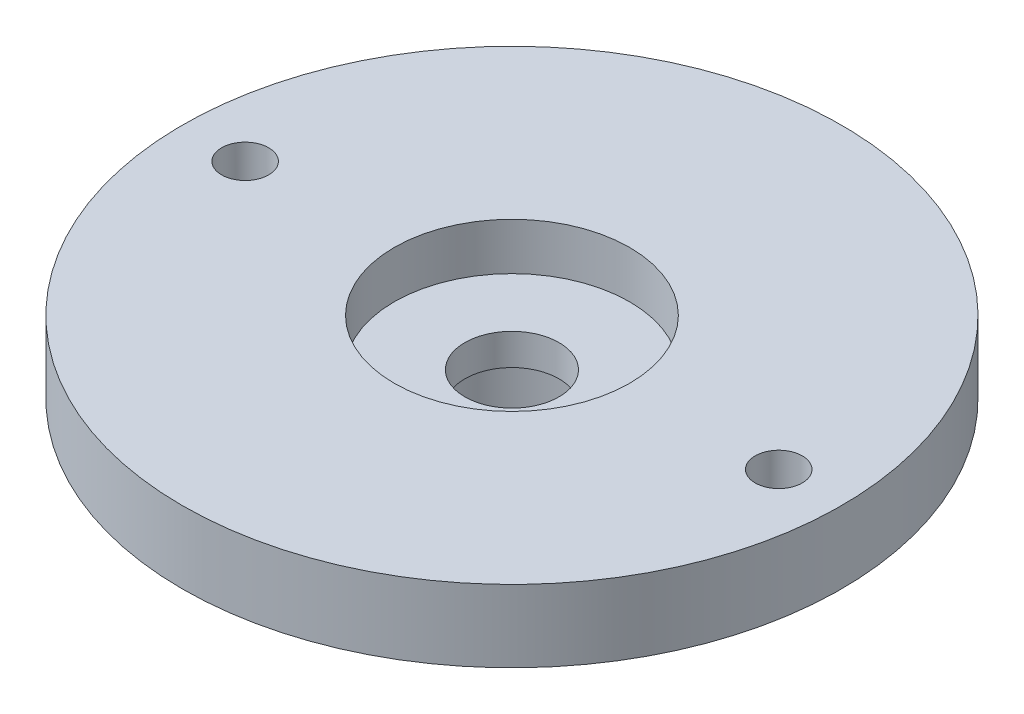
from build123d import *

# Parameters (mm, degrees)
SKICA2_R                 = 0.75
ODEBRAT_VYSUNUT_M1_DEPTH = 16.835087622


with BuildPart() as part:
    # Skica1 → Z_klad-Rota_n (revolve)
    with BuildSketch(Plane.XY, mode=Mode.PRIVATE) as z_klad_rota_n_sk:
        Polygon((3, 0), (4.5, 0), (4.5, 3.2), (10.5, 3.2), (10.5, 5.5), (3.75, 5.5), (3.75, 4), (1.5, 4), (1.5, 3), (3, 3), align=None)
    revolve(z_klad_rota_n_sk.sketch.rotate(Axis((0, 9.560859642, 0), (0, -1, 0)), 90), axis=Axis((0, 9.560859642, 0), (0, -1, 0)))

    # Skica2 → Odebrat vysunut_m1 (cut, through all)
    with BuildSketch(Plane(origin=(0, 5.5, 0), x_dir=(-1, 0, 0), z_dir=(0, 1, 0))):
        with Locations(Location((-8.5, 0, 0), (0, 0, 90))):
            Circle(SKICA2_R)
        with Locations(Location((8.5, 0, 0), (0, 0, 90))):
            Circle(SKICA2_R)
    extrude(amount=-ODEBRAT_VYSUNUT_M1_DEPTH, mode=Mode.SUBTRACT)


solid = part.part
